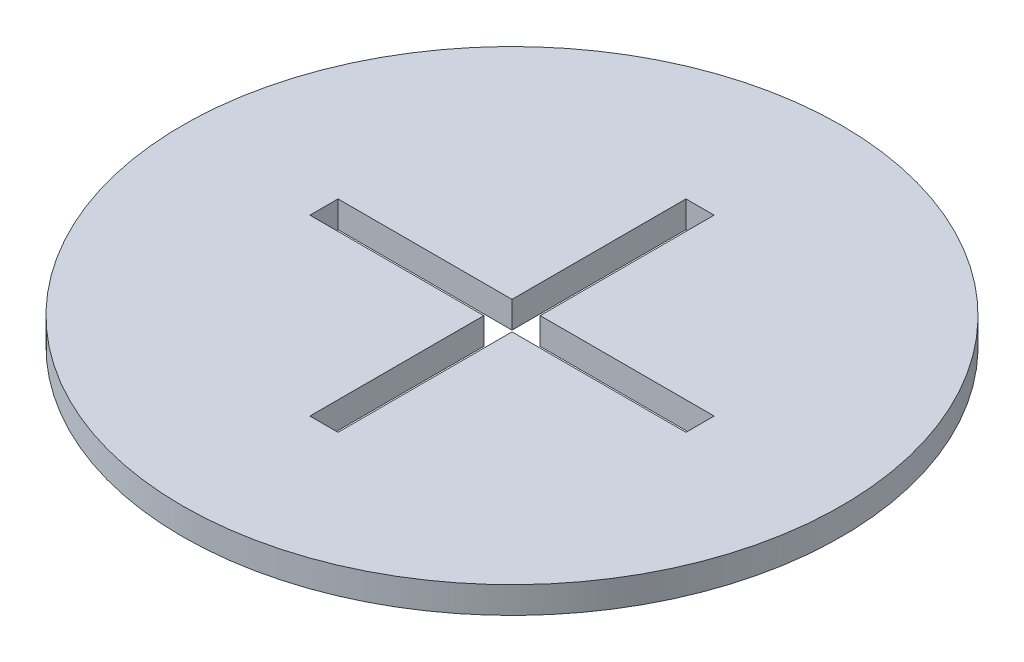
from build123d import *

# Parameters (mm, degrees)
SCHIZZO6_R                   = 222.5
ESTRUSIONE_ESTRUSIONE2_DEPTH = 18


with BuildPart() as part:
    # Schizzo6 → Estrusione-Estrusione2 (new body)
    with BuildSketch(Plane(origin=(0, 0, 0), x_dir=(1, 0, 0), z_dir=(0, 1, 0))):
        with Locations(Location((222.5, 222.5, 0), (0, 0, 270))):
            Circle(SCHIZZO6_R)
        Polygon((95.54248142, 213), (95.54248142, 232), (213, 232), (213, 349.45751858), (232, 349.45751858), (232, 232), (349.45751858, 232), (349.45751858, 213), (232, 213), (232, 95.54248142), (213, 95.54248142), (213, 213), align=None, mode=Mode.SUBTRACT)
    extrude(amount=ESTRUSIONE_ESTRUSIONE2_DEPTH)


solid = part.part
